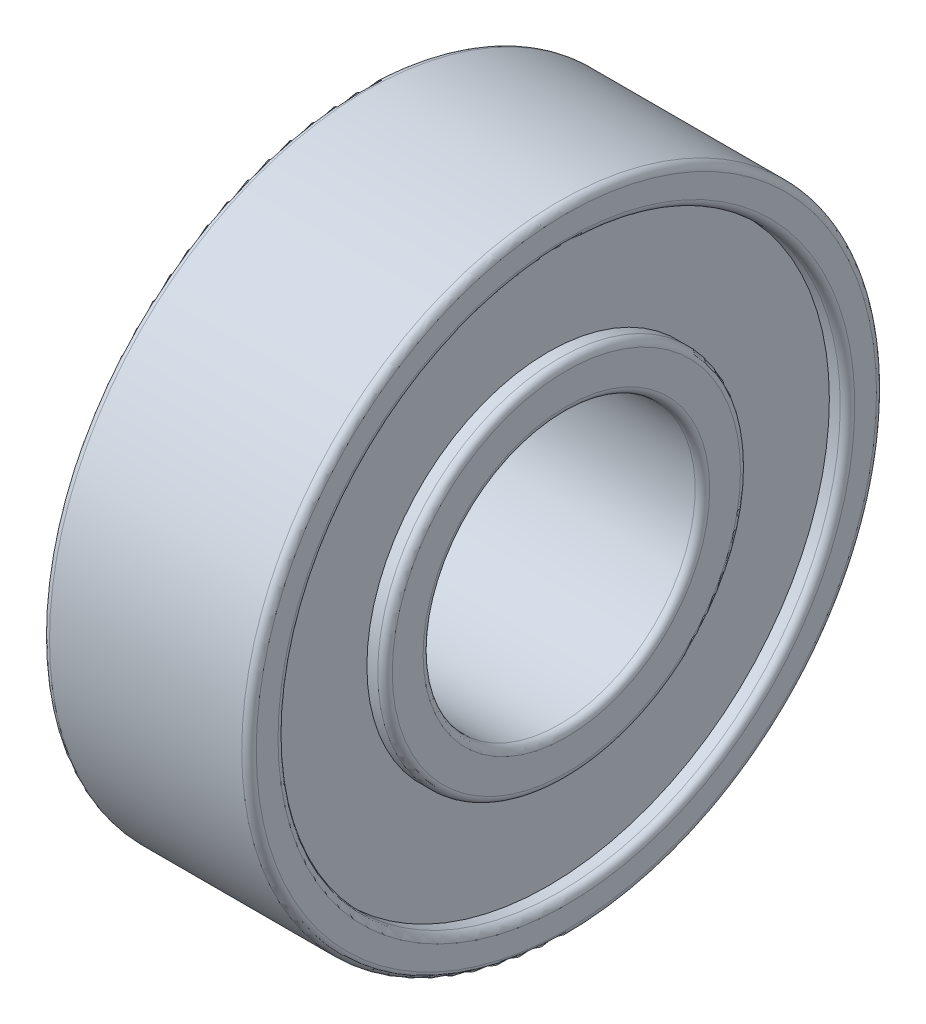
ISO-10303-21;
HEADER;
FILE_DESCRIPTION(('STEP AP214'),'2;1');
FILE_NAME('part.step','',(''),(''),'','','');
FILE_SCHEMA(('AUTOMOTIVE_DESIGN { 1 0 10303 214 1 1 1 1 }'));
ENDSEC;
DATA;
#1=APPLICATION_CONTEXT('core data for automotive mechanical design processes');
#2=APPLICATION_PROTOCOL_DEFINITION('international standard','automotive_design',2000,#1);
#3=PRODUCT_CONTEXT('',#1,'mechanical');
#4=PRODUCT('Part','Part','',(#3));
#5=PRODUCT_RELATED_PRODUCT_CATEGORY('part','',(#4));
#6=PRODUCT_DEFINITION_FORMATION('','',#4);
#7=PRODUCT_DEFINITION_CONTEXT('part definition',#1,'design');
#8=PRODUCT_DEFINITION('design','',#6,#7);
#9=PRODUCT_DEFINITION_SHAPE('','',#8);
#10=(LENGTH_UNIT() NAMED_UNIT(*) SI_UNIT(.MILLI.,.METRE.));
#11=(NAMED_UNIT(*) PLANE_ANGLE_UNIT() SI_UNIT($,.RADIAN.));
#12=(NAMED_UNIT(*) SI_UNIT($,.STERADIAN.) SOLID_ANGLE_UNIT());
#13=UNCERTAINTY_MEASURE_WITH_UNIT(LENGTH_MEASURE(1.E-05),#10,'distance_accuracy_value','');
#14=(GEOMETRIC_REPRESENTATION_CONTEXT(3) GLOBAL_UNCERTAINTY_ASSIGNED_CONTEXT((#13)) GLOBAL_UNIT_ASSIGNED_CONTEXT((#10,
#11,#12)) REPRESENTATION_CONTEXT('',''));
#15=CARTESIAN_POINT('',(0.,0.,0.));
#16=DIRECTION('',(0.,0.,1.));
#17=DIRECTION('',(1.,0.,0.));
#18=AXIS2_PLACEMENT_3D('',#15,#16,#17);
#19=CARTESIAN_POINT('',(-3.3655,0.,0.));
#20=DIRECTION('',(-1.,0.,0.));
#21=DIRECTION('',(0.,0.,1.));
#22=AXIS2_PLACEMENT_3D('',#19,#20,#21);
#23=TOROIDAL_SURFACE('',#22,10.8585,0.254);
#24=CARTESIAN_POINT('',(-3.6195,0.,0.));
#25=DIRECTION('',(-1.,0.,0.));
#26=DIRECTION('',(0.,0.,1.));
#27=AXIS2_PLACEMENT_3D('',#24,#25,#26);
#28=CIRCLE('',#27,10.8585);
#29=CARTESIAN_POINT('',(-3.6195,0.,10.8585));
#30=VERTEX_POINT('',#29);
#31=EDGE_CURVE('E10',#30,#30,#28,.T.);
#32=ORIENTED_EDGE('',*,*,#31,.F.);
#33=EDGE_LOOP('',(#32));
#34=FACE_BOUND('',#33,.T.);
#35=CARTESIAN_POINT('',(-3.3655,0.,0.));
#36=DIRECTION('',(-1.,0.,0.));
#37=DIRECTION('',(0.,0.,1.));
#38=AXIS2_PLACEMENT_3D('',#35,#36,#37);
#39=CIRCLE('',#38,11.1125);
#40=CARTESIAN_POINT('',(-3.3655,0.,11.1125));
#41=VERTEX_POINT('',#40);
#42=EDGE_CURVE('E94',#41,#41,#39,.T.);
#43=ORIENTED_EDGE('',*,*,#42,.T.);
#44=EDGE_LOOP('',(#43));
#45=FACE_BOUND('',#44,.T.);
#46=ADVANCED_FACE('F30',(#34,#45),#23,.T.);
#47=CARTESIAN_POINT('',(-3.6195,10.8585,0.));
#48=DIRECTION('',(1.,0.,0.));
#49=DIRECTION('',(0.,0.,-1.));
#50=AXIS2_PLACEMENT_3D('',#47,#48,#49);
#51=PLANE('',#50);
#52=CARTESIAN_POINT('',(-3.6195,0.,0.));
#53=DIRECTION('',(-1.,0.,0.));
#54=DIRECTION('',(0.,0.,1.));
#55=AXIS2_PLACEMENT_3D('',#52,#53,#54);
#56=CIRCLE('',#55,10.0965);
#57=CARTESIAN_POINT('',(-3.6195,0.,10.0965));
#58=VERTEX_POINT('',#57);
#59=EDGE_CURVE('E36',#58,#58,#56,.T.);
#60=ORIENTED_EDGE('',*,*,#59,.F.);
#61=EDGE_LOOP('',(#60));
#62=FACE_BOUND('',#61,.T.);
#63=ORIENTED_EDGE('',*,*,#31,.T.);
#64=EDGE_LOOP('',(#63));
#65=FACE_BOUND('',#64,.T.);
#66=ADVANCED_FACE('F203',(#62,#65),#51,.F.);
#67=CARTESIAN_POINT('',(-3.3655,0.,0.));
#68=DIRECTION('',(-1.,0.,0.));
#69=DIRECTION('',(0.,0.,1.));
#70=AXIS2_PLACEMENT_3D('',#67,#68,#69);
#71=TOROIDAL_SURFACE('',#70,10.0965,0.254000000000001);
#72=CARTESIAN_POINT('',(-3.3655,0.,0.));
#73=DIRECTION('',(-1.,0.,0.));
#74=DIRECTION('',(0.,0.,1.));
#75=AXIS2_PLACEMENT_3D('',#72,#73,#74);
#76=CIRCLE('',#75,9.8425);
#77=CARTESIAN_POINT('',(-3.3655,0.,9.8425));
#78=VERTEX_POINT('',#77);
#79=EDGE_CURVE('E40',#78,#78,#76,.T.);
#80=ORIENTED_EDGE('',*,*,#79,.F.);
#81=EDGE_LOOP('',(#80));
#82=FACE_BOUND('',#81,.T.);
#83=ORIENTED_EDGE('',*,*,#59,.T.);
#84=EDGE_LOOP('',(#83));
#85=FACE_BOUND('',#84,.T.);
#86=ADVANCED_FACE('F198',(#82,#85),#71,.T.);
#87=CARTESIAN_POINT('',(-3.04937377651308,0.,0.));
#88=DIRECTION('',(-1.,0.,0.));
#89=DIRECTION('',(0.,0.,1.));
#90=AXIS2_PLACEMENT_3D('',#87,#88,#89);
#91=CYLINDRICAL_SURFACE('',#90,9.8425);
#92=CARTESIAN_POINT('',(-2.9845,0.,0.));
#93=DIRECTION('',(-1.,0.,0.));
#94=DIRECTION('',(0.,0.,1.));
#95=AXIS2_PLACEMENT_3D('',#92,#93,#94);
#96=CIRCLE('',#95,9.8425);
#97=CARTESIAN_POINT('',(-2.9845,0.,9.8425));
#98=VERTEX_POINT('',#97);
#99=EDGE_CURVE('E44',#98,#98,#96,.T.);
#100=ORIENTED_EDGE('',*,*,#99,.F.);
#101=EDGE_LOOP('',(#100));
#102=FACE_BOUND('',#101,.T.);
#103=ORIENTED_EDGE('',*,*,#79,.T.);
#104=EDGE_LOOP('',(#103));
#105=FACE_BOUND('',#104,.T.);
#106=ADVANCED_FACE('F192',(#102,#105),#91,.F.);
#107=CARTESIAN_POINT('',(-2.9845,9.84250000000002,0.));
#108=DIRECTION('',(1.,0.,0.));
#109=DIRECTION('',(0.,0.,-1.));
#110=AXIS2_PLACEMENT_3D('',#107,#108,#109);
#111=PLANE('',#110);
#112=CARTESIAN_POINT('',(-2.9845,0.,0.));
#113=DIRECTION('',(-1.,0.,0.));
#114=DIRECTION('',(0.,0.,1.));
#115=AXIS2_PLACEMENT_3D('',#112,#113,#114);
#116=CIRCLE('',#115,6.35);
#117=CARTESIAN_POINT('',(-2.9845,0.,6.34999999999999));
#118=VERTEX_POINT('',#117);
#119=EDGE_CURVE('E49',#118,#118,#116,.T.);
#120=ORIENTED_EDGE('',*,*,#119,.F.);
#121=EDGE_LOOP('',(#120));
#122=FACE_BOUND('',#121,.T.);
#123=ORIENTED_EDGE('',*,*,#99,.T.);
#124=EDGE_LOOP('',(#123));
#125=FACE_BOUND('',#124,.T.);
#126=ADVANCED_FACE('F186',(#122,#125),#111,.F.);
#127=CARTESIAN_POINT('',(-3.04937377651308,0.,0.));
#128=DIRECTION('',(-1.,0.,0.));
#129=DIRECTION('',(0.,0.,1.));
#130=AXIS2_PLACEMENT_3D('',#127,#128,#129);
#131=CYLINDRICAL_SURFACE('',#130,6.35);
#132=CARTESIAN_POINT('',(-3.3655,0.,0.));
#133=DIRECTION('',(-1.,0.,0.));
#134=DIRECTION('',(0.,0.,1.));
#135=AXIS2_PLACEMENT_3D('',#132,#133,#134);
#136=CIRCLE('',#135,6.35);
#137=CARTESIAN_POINT('',(-3.3655,0.,6.34999999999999));
#138=VERTEX_POINT('',#137);
#139=EDGE_CURVE('E52',#138,#138,#136,.T.);
#140=ORIENTED_EDGE('',*,*,#139,.F.);
#141=EDGE_LOOP('',(#140));
#142=FACE_BOUND('',#141,.T.);
#143=ORIENTED_EDGE('',*,*,#119,.T.);
#144=EDGE_LOOP('',(#143));
#145=FACE_BOUND('',#144,.T.);
#146=ADVANCED_FACE('F180',(#142,#145),#131,.T.);
#147=CARTESIAN_POINT('',(-3.3655,0.,0.));
#148=DIRECTION('',(-1.,0.,0.));
#149=DIRECTION('',(0.,0.,1.));
#150=AXIS2_PLACEMENT_3D('',#147,#148,#149);
#151=TOROIDAL_SURFACE('',#150,6.096,0.254);
#152=CARTESIAN_POINT('',(-3.6195,0.,0.));
#153=DIRECTION('',(-1.,0.,0.));
#154=DIRECTION('',(0.,0.,1.));
#155=AXIS2_PLACEMENT_3D('',#152,#153,#154);
#156=CIRCLE('',#155,6.096);
#157=CARTESIAN_POINT('',(-3.6195,0.,6.09599999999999));
#158=VERTEX_POINT('',#157);
#159=EDGE_CURVE('E55',#158,#158,#156,.T.);
#160=ORIENTED_EDGE('',*,*,#159,.F.);
#161=EDGE_LOOP('',(#160));
#162=FACE_BOUND('',#161,.T.);
#163=ORIENTED_EDGE('',*,*,#139,.T.);
#164=EDGE_LOOP('',(#163));
#165=FACE_BOUND('',#164,.T.);
#166=ADVANCED_FACE('F174',(#162,#165),#151,.T.);
#167=CARTESIAN_POINT('',(-3.6195,6.096,0.));
#168=DIRECTION('',(1.,0.,0.));
#169=DIRECTION('',(0.,0.,-1.));
#170=AXIS2_PLACEMENT_3D('',#167,#168,#169);
#171=PLANE('',#170);
#172=CARTESIAN_POINT('',(-3.6195,0.,0.));
#173=DIRECTION('',(-1.,0.,0.));
#174=DIRECTION('',(0.,0.,1.));
#175=AXIS2_PLACEMENT_3D('',#172,#173,#174);
#176=CIRCLE('',#175,5.0165);
#177=CARTESIAN_POINT('',(-3.6195,0.,5.01649999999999));
#178=VERTEX_POINT('',#177);
#179=EDGE_CURVE('E58',#178,#178,#176,.T.);
#180=ORIENTED_EDGE('',*,*,#179,.F.);
#181=EDGE_LOOP('',(#180));
#182=FACE_BOUND('',#181,.T.);
#183=ORIENTED_EDGE('',*,*,#159,.T.);
#184=EDGE_LOOP('',(#183));
#185=FACE_BOUND('',#184,.T.);
#186=ADVANCED_FACE('F168',(#182,#185),#171,.F.);
#187=CARTESIAN_POINT('',(-3.3655,0.,0.));
#188=DIRECTION('',(-1.,0.,0.));
#189=DIRECTION('',(0.,0.,1.));
#190=AXIS2_PLACEMENT_3D('',#187,#188,#189);
#191=TOROIDAL_SURFACE('',#190,5.0165,0.254);
#192=CARTESIAN_POINT('',(-3.3655,0.,0.));
#193=DIRECTION('',(-1.,0.,0.));
#194=DIRECTION('',(0.,0.,1.));
#195=AXIS2_PLACEMENT_3D('',#192,#193,#194);
#196=CIRCLE('',#195,4.7625);
#197=CARTESIAN_POINT('',(-3.3655,0.,4.76249999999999));
#198=VERTEX_POINT('',#197);
#199=EDGE_CURVE('E61',#198,#198,#196,.T.);
#200=ORIENTED_EDGE('',*,*,#199,.F.);
#201=EDGE_LOOP('',(#200));
#202=FACE_BOUND('',#201,.T.);
#203=ORIENTED_EDGE('',*,*,#179,.T.);
#204=EDGE_LOOP('',(#203));
#205=FACE_BOUND('',#204,.T.);
#206=ADVANCED_FACE('F162',(#202,#205),#191,.T.);
#207=CARTESIAN_POINT('',(-3.04937377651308,0.,0.));
#208=DIRECTION('',(-1.,0.,0.));
#209=DIRECTION('',(0.,0.,1.));
#210=AXIS2_PLACEMENT_3D('',#207,#208,#209);
#211=CYLINDRICAL_SURFACE('',#210,4.7625);
#212=CARTESIAN_POINT('',(3.3655,0.,0.));
#213=DIRECTION('',(-1.,0.,0.));
#214=DIRECTION('',(0.,0.,1.));
#215=AXIS2_PLACEMENT_3D('',#212,#213,#214);
#216=CIRCLE('',#215,4.7625);
#217=CARTESIAN_POINT('',(3.3655,0.,4.76250000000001));
#218=VERTEX_POINT('',#217);
#219=EDGE_CURVE('E64',#218,#218,#216,.T.);
#220=ORIENTED_EDGE('',*,*,#219,.F.);
#221=EDGE_LOOP('',(#220));
#222=FACE_BOUND('',#221,.T.);
#223=ORIENTED_EDGE('',*,*,#199,.T.);
#224=EDGE_LOOP('',(#223));
#225=FACE_BOUND('',#224,.T.);
#226=ADVANCED_FACE('F156',(#222,#225),#211,.F.);
#227=CARTESIAN_POINT('',(3.3655,0.,0.));
#228=DIRECTION('',(-1.,0.,0.));
#229=DIRECTION('',(0.,0.,1.));
#230=AXIS2_PLACEMENT_3D('',#227,#228,#229);
#231=TOROIDAL_SURFACE('',#230,5.0165,0.254);
#232=CARTESIAN_POINT('',(3.6195,0.,0.));
#233=DIRECTION('',(-1.,0.,0.));
#234=DIRECTION('',(0.,0.,1.));
#235=AXIS2_PLACEMENT_3D('',#232,#233,#234);
#236=CIRCLE('',#235,5.0165);
#237=CARTESIAN_POINT('',(3.6195,0.,5.01650000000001));
#238=VERTEX_POINT('',#237);
#239=EDGE_CURVE('E67',#238,#238,#236,.T.);
#240=ORIENTED_EDGE('',*,*,#239,.F.);
#241=EDGE_LOOP('',(#240));
#242=FACE_BOUND('',#241,.T.);
#243=ORIENTED_EDGE('',*,*,#219,.T.);
#244=EDGE_LOOP('',(#243));
#245=FACE_BOUND('',#244,.T.);
#246=ADVANCED_FACE('F150',(#242,#245),#231,.T.);
#247=CARTESIAN_POINT('',(3.61950000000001,5.01650000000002,0.));
#248=DIRECTION('',(-1.,0.,0.));
#249=DIRECTION('',(0.,0.,1.));
#250=AXIS2_PLACEMENT_3D('',#247,#248,#249);
#251=PLANE('',#250);
#252=CARTESIAN_POINT('',(3.6195,0.,0.));
#253=DIRECTION('',(-1.,0.,0.));
#254=DIRECTION('',(0.,0.,1.));
#255=AXIS2_PLACEMENT_3D('',#252,#253,#254);
#256=CIRCLE('',#255,6.096);
#257=CARTESIAN_POINT('',(3.6195,0.,6.09600000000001));
#258=VERTEX_POINT('',#257);
#259=EDGE_CURVE('E70',#258,#258,#256,.T.);
#260=ORIENTED_EDGE('',*,*,#259,.F.);
#261=EDGE_LOOP('',(#260));
#262=FACE_BOUND('',#261,.T.);
#263=ORIENTED_EDGE('',*,*,#239,.T.);
#264=EDGE_LOOP('',(#263));
#265=FACE_BOUND('',#264,.T.);
#266=ADVANCED_FACE('F144',(#262,#265),#251,.F.);
#267=CARTESIAN_POINT('',(3.3655,0.,0.));
#268=DIRECTION('',(-1.,0.,0.));
#269=DIRECTION('',(0.,0.,1.));
#270=AXIS2_PLACEMENT_3D('',#267,#268,#269);
#271=TOROIDAL_SURFACE('',#270,6.096,0.254);
#272=CARTESIAN_POINT('',(3.3655,0.,0.));
#273=DIRECTION('',(-1.,0.,0.));
#274=DIRECTION('',(0.,0.,1.));
#275=AXIS2_PLACEMENT_3D('',#272,#273,#274);
#276=CIRCLE('',#275,6.35);
#277=CARTESIAN_POINT('',(3.3655,0.,6.35000000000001));
#278=VERTEX_POINT('',#277);
#279=EDGE_CURVE('E73',#278,#278,#276,.T.);
#280=ORIENTED_EDGE('',*,*,#279,.F.);
#281=EDGE_LOOP('',(#280));
#282=FACE_BOUND('',#281,.T.);
#283=ORIENTED_EDGE('',*,*,#259,.T.);
#284=EDGE_LOOP('',(#283));
#285=FACE_BOUND('',#284,.T.);
#286=ADVANCED_FACE('F138',(#282,#285),#271,.T.);
#287=CARTESIAN_POINT('',(-3.04937377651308,0.,0.));
#288=DIRECTION('',(-1.,0.,0.));
#289=DIRECTION('',(0.,0.,1.));
#290=AXIS2_PLACEMENT_3D('',#287,#288,#289);
#291=CYLINDRICAL_SURFACE('',#290,6.35);
#292=CARTESIAN_POINT('',(2.9845,0.,0.));
#293=DIRECTION('',(-1.,0.,0.));
#294=DIRECTION('',(0.,0.,1.));
#295=AXIS2_PLACEMENT_3D('',#292,#293,#294);
#296=CIRCLE('',#295,6.35);
#297=CARTESIAN_POINT('',(2.9845,0.,6.35000000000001));
#298=VERTEX_POINT('',#297);
#299=EDGE_CURVE('E76',#298,#298,#296,.T.);
#300=ORIENTED_EDGE('',*,*,#299,.F.);
#301=EDGE_LOOP('',(#300));
#302=FACE_BOUND('',#301,.T.);
#303=ORIENTED_EDGE('',*,*,#279,.T.);
#304=EDGE_LOOP('',(#303));
#305=FACE_BOUND('',#304,.T.);
#306=ADVANCED_FACE('F132',(#302,#305),#291,.T.);
#307=CARTESIAN_POINT('',(2.9845,6.35000000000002,0.));
#308=DIRECTION('',(-1.,0.,0.));
#309=DIRECTION('',(0.,0.,1.));
#310=AXIS2_PLACEMENT_3D('',#307,#308,#309);
#311=PLANE('',#310);
#312=CARTESIAN_POINT('',(2.9845,0.,0.));
#313=DIRECTION('',(-1.,0.,0.));
#314=DIRECTION('',(0.,0.,1.));
#315=AXIS2_PLACEMENT_3D('',#312,#313,#314);
#316=CIRCLE('',#315,9.8425);
#317=CARTESIAN_POINT('',(2.9845,0.,9.84250000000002));
#318=VERTEX_POINT('',#317);
#319=EDGE_CURVE('E79',#318,#318,#316,.T.);
#320=ORIENTED_EDGE('',*,*,#319,.F.);
#321=EDGE_LOOP('',(#320));
#322=FACE_BOUND('',#321,.T.);
#323=ORIENTED_EDGE('',*,*,#299,.T.);
#324=EDGE_LOOP('',(#323));
#325=FACE_BOUND('',#324,.T.);
#326=ADVANCED_FACE('F126',(#322,#325),#311,.F.);
#327=CARTESIAN_POINT('',(-3.04937377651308,0.,0.));
#328=DIRECTION('',(-1.,0.,0.));
#329=DIRECTION('',(0.,0.,1.));
#330=AXIS2_PLACEMENT_3D('',#327,#328,#329);
#331=CYLINDRICAL_SURFACE('',#330,9.8425);
#332=CARTESIAN_POINT('',(3.3655,0.,0.));
#333=DIRECTION('',(-1.,0.,0.));
#334=DIRECTION('',(0.,0.,1.));
#335=AXIS2_PLACEMENT_3D('',#332,#333,#334);
#336=CIRCLE('',#335,9.8425);
#337=CARTESIAN_POINT('',(3.3655,0.,9.84250000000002));
#338=VERTEX_POINT('',#337);
#339=EDGE_CURVE('E82',#338,#338,#336,.T.);
#340=ORIENTED_EDGE('',*,*,#339,.F.);
#341=EDGE_LOOP('',(#340));
#342=FACE_BOUND('',#341,.T.);
#343=ORIENTED_EDGE('',*,*,#319,.T.);
#344=EDGE_LOOP('',(#343));
#345=FACE_BOUND('',#344,.T.);
#346=ADVANCED_FACE('F120',(#342,#345),#331,.F.);
#347=CARTESIAN_POINT('',(3.3655,0.,0.));
#348=DIRECTION('',(-1.,0.,0.));
#349=DIRECTION('',(0.,0.,1.));
#350=AXIS2_PLACEMENT_3D('',#347,#348,#349);
#351=TOROIDAL_SURFACE('',#350,10.0965,0.254);
#352=CARTESIAN_POINT('',(3.6195,0.,0.));
#353=DIRECTION('',(-1.,0.,0.));
#354=DIRECTION('',(0.,0.,1.));
#355=AXIS2_PLACEMENT_3D('',#352,#353,#354);
#356=CIRCLE('',#355,10.0965);
#357=CARTESIAN_POINT('',(3.6195,0.,10.0965));
#358=VERTEX_POINT('',#357);
#359=EDGE_CURVE('E85',#358,#358,#356,.T.);
#360=ORIENTED_EDGE('',*,*,#359,.F.);
#361=EDGE_LOOP('',(#360));
#362=FACE_BOUND('',#361,.T.);
#363=ORIENTED_EDGE('',*,*,#339,.T.);
#364=EDGE_LOOP('',(#363));
#365=FACE_BOUND('',#364,.T.);
#366=ADVANCED_FACE('F114',(#362,#365),#351,.T.);
#367=CARTESIAN_POINT('',(3.6195,10.0965,0.));
#368=DIRECTION('',(-1.,0.,0.));
#369=DIRECTION('',(0.,0.,1.));
#370=AXIS2_PLACEMENT_3D('',#367,#368,#369);
#371=PLANE('',#370);
#372=CARTESIAN_POINT('',(3.6195,0.,0.));
#373=DIRECTION('',(-1.,0.,0.));
#374=DIRECTION('',(0.,0.,1.));
#375=AXIS2_PLACEMENT_3D('',#372,#373,#374);
#376=CIRCLE('',#375,10.8585);
#377=CARTESIAN_POINT('',(3.6195,0.,10.8585));
#378=VERTEX_POINT('',#377);
#379=EDGE_CURVE('E88',#378,#378,#376,.T.);
#380=ORIENTED_EDGE('',*,*,#379,.F.);
#381=EDGE_LOOP('',(#380));
#382=FACE_BOUND('',#381,.T.);
#383=ORIENTED_EDGE('',*,*,#359,.T.);
#384=EDGE_LOOP('',(#383));
#385=FACE_BOUND('',#384,.T.);
#386=ADVANCED_FACE('F108',(#382,#385),#371,.F.);
#387=CARTESIAN_POINT('',(3.3655,0.,0.));
#388=DIRECTION('',(-1.,0.,0.));
#389=DIRECTION('',(0.,0.,1.));
#390=AXIS2_PLACEMENT_3D('',#387,#388,#389);
#391=TOROIDAL_SURFACE('',#390,10.8585,0.254000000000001);
#392=CARTESIAN_POINT('',(3.3655,0.,0.));
#393=DIRECTION('',(-1.,0.,0.));
#394=DIRECTION('',(0.,0.,1.));
#395=AXIS2_PLACEMENT_3D('',#392,#393,#394);
#396=CIRCLE('',#395,11.1125);
#397=CARTESIAN_POINT('',(3.3655,0.,11.1125));
#398=VERTEX_POINT('',#397);
#399=EDGE_CURVE('E91',#398,#398,#396,.T.);
#400=ORIENTED_EDGE('',*,*,#399,.F.);
#401=EDGE_LOOP('',(#400));
#402=FACE_BOUND('',#401,.T.);
#403=ORIENTED_EDGE('',*,*,#379,.T.);
#404=EDGE_LOOP('',(#403));
#405=FACE_BOUND('',#404,.T.);
#406=ADVANCED_FACE('F102',(#402,#405),#391,.T.);
#407=CARTESIAN_POINT('',(-3.04937377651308,0.,0.));
#408=DIRECTION('',(-1.,0.,0.));
#409=DIRECTION('',(0.,0.,1.));
#410=AXIS2_PLACEMENT_3D('',#407,#408,#409);
#411=CYLINDRICAL_SURFACE('',#410,11.1125);
#412=ORIENTED_EDGE('',*,*,#42,.F.);
#413=EDGE_LOOP('',(#412));
#414=FACE_BOUND('',#413,.T.);
#415=ORIENTED_EDGE('',*,*,#399,.T.);
#416=EDGE_LOOP('',(#415));
#417=FACE_BOUND('',#416,.T.);
#418=ADVANCED_FACE('F99',(#414,#417),#411,.T.);
#419=CLOSED_SHELL('',(#46,#66,#86,#106,#126,#146,#166,#186,#206,#226,#246,#266,#286,#306,#326,
#346,#366,#386,#406,#418));
#420=MANIFOLD_SOLID_BREP('B2',#419);
#421=ADVANCED_BREP_SHAPE_REPRESENTATION('',(#18,#420),#14);
#422=SHAPE_DEFINITION_REPRESENTATION(#9,#421);
ENDSEC;
END-ISO-10303-21;
